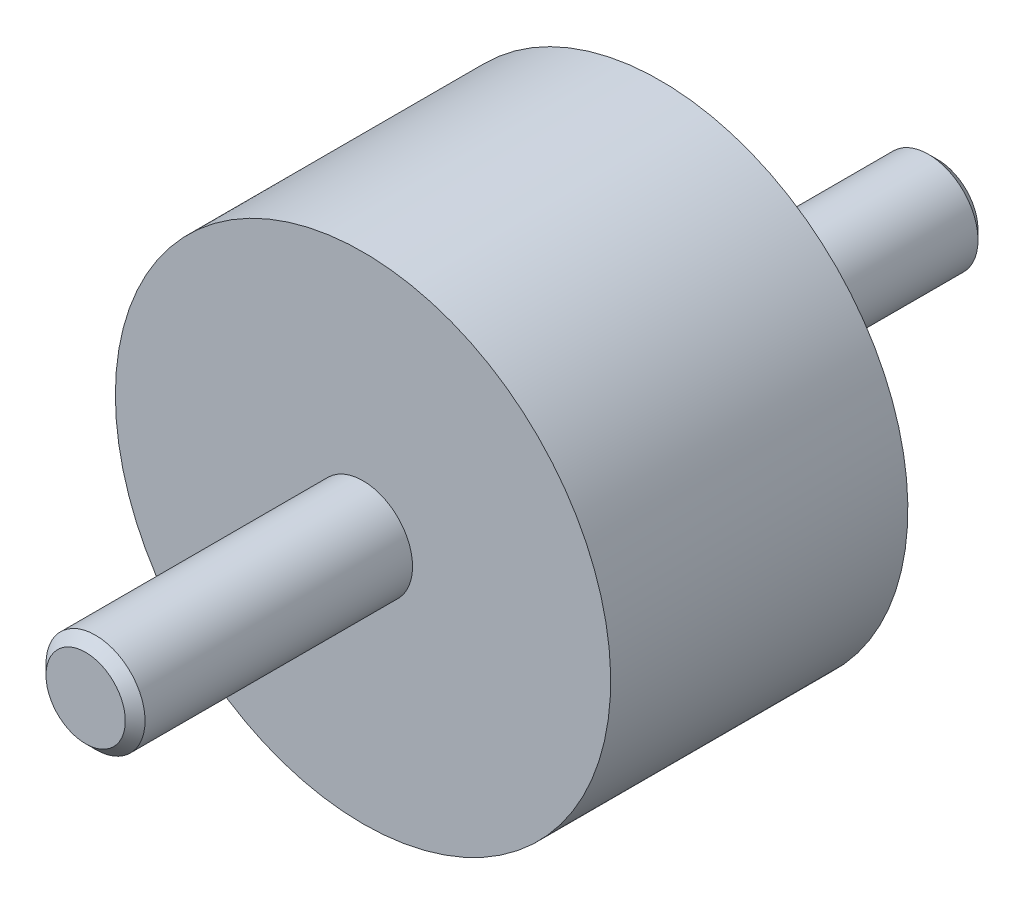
ISO-10303-21;
HEADER;
FILE_DESCRIPTION(('STEP AP214'),'2;1');
FILE_NAME('part.step','',(''),(''),'','','');
FILE_SCHEMA(('AUTOMOTIVE_DESIGN { 1 0 10303 214 1 1 1 1 }'));
ENDSEC;
DATA;
#1=APPLICATION_CONTEXT('core data for automotive mechanical design processes');
#2=APPLICATION_PROTOCOL_DEFINITION('international standard','automotive_design',2000,#1);
#3=PRODUCT_CONTEXT('',#1,'mechanical');
#4=PRODUCT('Part','Part','',(#3));
#5=PRODUCT_RELATED_PRODUCT_CATEGORY('part','',(#4));
#6=PRODUCT_DEFINITION_FORMATION('','',#4);
#7=PRODUCT_DEFINITION_CONTEXT('part definition',#1,'design');
#8=PRODUCT_DEFINITION('design','',#6,#7);
#9=PRODUCT_DEFINITION_SHAPE('','',#8);
#10=(LENGTH_UNIT() NAMED_UNIT(*) SI_UNIT(.MILLI.,.METRE.));
#11=(NAMED_UNIT(*) PLANE_ANGLE_UNIT() SI_UNIT($,.RADIAN.));
#12=(NAMED_UNIT(*) SI_UNIT($,.STERADIAN.) SOLID_ANGLE_UNIT());
#13=UNCERTAINTY_MEASURE_WITH_UNIT(LENGTH_MEASURE(1.E-05),#10,'distance_accuracy_value','');
#14=(GEOMETRIC_REPRESENTATION_CONTEXT(3) GLOBAL_UNCERTAINTY_ASSIGNED_CONTEXT((#13)) GLOBAL_UNIT_ASSIGNED_CONTEXT((#10,
#11,#12)) REPRESENTATION_CONTEXT('',''));
#15=CARTESIAN_POINT('',(0.,0.,0.));
#16=DIRECTION('',(0.,0.,1.));
#17=DIRECTION('',(1.,0.,0.));
#18=AXIS2_PLACEMENT_3D('',#15,#16,#17);
#19=CARTESIAN_POINT('',(0.,0.,0.66666666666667));
#20=DIRECTION('',(0.,0.,1.));
#21=DIRECTION('',(0.,-1.,0.));
#22=AXIS2_PLACEMENT_3D('',#19,#20,#21);
#23=CYLINDRICAL_SURFACE('',#22,25.);
#24=CARTESIAN_POINT('',(0.,0.,0.));
#25=DIRECTION('',(0.,0.,1.));
#26=DIRECTION('',(0.,-1.,0.));
#27=AXIS2_PLACEMENT_3D('',#24,#25,#26);
#28=CIRCLE('',#27,25.);
#29=CARTESIAN_POINT('',(0.,-25.,0.));
#30=VERTEX_POINT('',#29);
#31=EDGE_CURVE('E22',#30,#30,#28,.T.);
#32=ORIENTED_EDGE('',*,*,#31,.T.);
#33=EDGE_LOOP('',(#32));
#34=FACE_BOUND('',#33,.T.);
#35=CARTESIAN_POINT('',(0.,0.,30.));
#36=DIRECTION('',(0.,0.,-1.));
#37=DIRECTION('',(-1.,0.,0.));
#38=AXIS2_PLACEMENT_3D('',#35,#36,#37);
#39=CIRCLE('',#38,25.);
#40=CARTESIAN_POINT('',(-25.,0.,30.));
#41=VERTEX_POINT('',#40);
#42=EDGE_CURVE('E34',#41,#41,#39,.T.);
#43=ORIENTED_EDGE('',*,*,#42,.T.);
#44=EDGE_LOOP('',(#43));
#45=FACE_BOUND('',#44,.T.);
#46=ADVANCED_FACE('F12',(#34,#45),#23,.T.);
#47=CARTESIAN_POINT('',(25.,0.,0.));
#48=DIRECTION('',(0.,0.,-1.));
#49=DIRECTION('',(0.,1.,0.));
#50=AXIS2_PLACEMENT_3D('',#47,#48,#49);
#51=PLANE('',#50);
#52=CARTESIAN_POINT('',(0.,0.,0.));
#53=DIRECTION('',(0.,0.,-1.));
#54=DIRECTION('',(0.,1.,0.));
#55=AXIS2_PLACEMENT_3D('',#52,#53,#54);
#56=CIRCLE('',#55,5.);
#57=CARTESIAN_POINT('',(0.,5.,0.));
#58=VERTEX_POINT('',#57);
#59=EDGE_CURVE('E18',#58,#58,#56,.T.);
#60=ORIENTED_EDGE('',*,*,#59,.F.);
#61=EDGE_LOOP('',(#60));
#62=FACE_BOUND('',#61,.T.);
#63=ORIENTED_EDGE('',*,*,#31,.F.);
#64=EDGE_LOOP('',(#63));
#65=FACE_BOUND('',#64,.T.);
#66=ADVANCED_FACE('F57',(#62,#65),#51,.T.);
#67=CARTESIAN_POINT('',(0.,0.,-28.));
#68=DIRECTION('',(0.,0.,1.));
#69=DIRECTION('',(0.,-1.,0.));
#70=AXIS2_PLACEMENT_3D('',#67,#68,#69);
#71=CYLINDRICAL_SURFACE('',#70,5.);
#72=CARTESIAN_POINT('',(0.,0.,-27.08));
#73=DIRECTION('',(0.,0.,1.));
#74=DIRECTION('',(0.,-1.,0.));
#75=AXIS2_PLACEMENT_3D('',#72,#73,#74);
#76=CIRCLE('',#75,5.);
#77=CARTESIAN_POINT('',(0.,-5.,-27.08));
#78=VERTEX_POINT('',#77);
#79=EDGE_CURVE('E26',#78,#78,#76,.T.);
#80=ORIENTED_EDGE('',*,*,#79,.T.);
#81=EDGE_LOOP('',(#80));
#82=FACE_BOUND('',#81,.T.);
#83=ORIENTED_EDGE('',*,*,#59,.T.);
#84=EDGE_LOOP('',(#83));
#85=FACE_BOUND('',#84,.T.);
#86=ADVANCED_FACE('F62',(#82,#85),#71,.T.);
#87=CARTESIAN_POINT('',(0.,0.,-27.08));
#88=DIRECTION('',(0.,0.,1.));
#89=DIRECTION('',(0.,-1.,0.));
#90=AXIS2_PLACEMENT_3D('',#87,#88,#89);
#91=CONICAL_SURFACE('',#90,5.,0.785398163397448);
#92=CARTESIAN_POINT('',(0.,0.,-28.));
#93=DIRECTION('',(0.,0.,1.));
#94=DIRECTION('',(0.,-1.,0.));
#95=AXIS2_PLACEMENT_3D('',#92,#93,#94);
#96=CIRCLE('',#95,4.08);
#97=CARTESIAN_POINT('',(0.,-4.08,-28.));
#98=VERTEX_POINT('',#97);
#99=EDGE_CURVE('E31',#98,#98,#96,.T.);
#100=ORIENTED_EDGE('',*,*,#99,.T.);
#101=EDGE_LOOP('',(#100));
#102=FACE_BOUND('',#101,.T.);
#103=ORIENTED_EDGE('',*,*,#79,.F.);
#104=EDGE_LOOP('',(#103));
#105=FACE_BOUND('',#104,.T.);
#106=ADVANCED_FACE('F78',(#102,#105),#91,.T.);
#107=CARTESIAN_POINT('',(4.08,0.,-28.));
#108=DIRECTION('',(0.,0.,-1.));
#109=DIRECTION('',(0.,1.,0.));
#110=AXIS2_PLACEMENT_3D('',#107,#108,#109);
#111=PLANE('',#110);
#112=ORIENTED_EDGE('',*,*,#99,.F.);
#113=EDGE_LOOP('',(#112));
#114=FACE_BOUND('',#113,.T.);
#115=ADVANCED_FACE('F70',(#114),#111,.T.);
#116=CARTESIAN_POINT('',(0.,25.,30.));
#117=DIRECTION('',(0.,0.,1.));
#118=DIRECTION('',(1.,0.,0.));
#119=AXIS2_PLACEMENT_3D('',#116,#117,#118);
#120=PLANE('',#119);
#121=CARTESIAN_POINT('',(0.,0.,30.));
#122=DIRECTION('',(0.,0.,1.));
#123=DIRECTION('',(1.,0.,0.));
#124=AXIS2_PLACEMENT_3D('',#121,#122,#123);
#125=CIRCLE('',#124,5.);
#126=CARTESIAN_POINT('',(5.,0.,30.));
#127=VERTEX_POINT('',#126);
#128=EDGE_CURVE('E8',#127,#127,#125,.F.);
#129=ORIENTED_EDGE('',*,*,#128,.T.);
#130=EDGE_LOOP('',(#129));
#131=FACE_BOUND('',#130,.T.);
#132=ORIENTED_EDGE('',*,*,#42,.F.);
#133=EDGE_LOOP('',(#132));
#134=FACE_BOUND('',#133,.T.);
#135=ADVANCED_FACE('F68',(#131,#134),#120,.T.);
#136=CARTESIAN_POINT('',(0.,0.,20.));
#137=DIRECTION('',(0.,0.,1.));
#138=DIRECTION('',(0.,-1.,0.));
#139=AXIS2_PLACEMENT_3D('',#136,#137,#138);
#140=CYLINDRICAL_SURFACE('',#139,5.);
#141=ORIENTED_EDGE('',*,*,#128,.F.);
#142=EDGE_LOOP('',(#141));
#143=FACE_BOUND('',#142,.T.);
#144=CARTESIAN_POINT('',(0.,0.,57.0023270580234));
#145=DIRECTION('',(0.,0.,-1.));
#146=DIRECTION('',(-1.,0.,0.));
#147=AXIS2_PLACEMENT_3D('',#144,#145,#146);
#148=CIRCLE('',#147,5.);
#149=CARTESIAN_POINT('',(-5.,0.,57.0023270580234));
#150=VERTEX_POINT('',#149);
#151=EDGE_CURVE('E37',#150,#150,#148,.T.);
#152=ORIENTED_EDGE('',*,*,#151,.T.);
#153=EDGE_LOOP('',(#152));
#154=FACE_BOUND('',#153,.T.);
#155=ADVANCED_FACE('F54',(#143,#154),#140,.T.);
#156=CARTESIAN_POINT('',(0.,0.,57.0023270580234));
#157=DIRECTION('',(0.,0.,-1.));
#158=DIRECTION('',(-1.,0.,0.));
#159=AXIS2_PLACEMENT_3D('',#156,#157,#158);
#160=CONICAL_SURFACE('',#159,5.,0.785398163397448);
#161=CARTESIAN_POINT('',(0.,0.,58.));
#162=DIRECTION('',(0.,0.,-1.));
#163=DIRECTION('',(-1.,0.,0.));
#164=AXIS2_PLACEMENT_3D('',#161,#162,#163);
#165=CIRCLE('',#164,4.00232705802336);
#166=CARTESIAN_POINT('',(-4.00232705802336,0.,58.));
#167=VERTEX_POINT('',#166);
#168=EDGE_CURVE('E40',#167,#167,#165,.T.);
#169=ORIENTED_EDGE('',*,*,#168,.T.);
#170=EDGE_LOOP('',(#169));
#171=FACE_BOUND('',#170,.T.);
#172=ORIENTED_EDGE('',*,*,#151,.F.);
#173=EDGE_LOOP('',(#172));
#174=FACE_BOUND('',#173,.T.);
#175=ADVANCED_FACE('F44',(#171,#174),#160,.T.);
#176=CARTESIAN_POINT('',(0.,4.00232705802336,58.));
#177=DIRECTION('',(0.,0.,1.));
#178=DIRECTION('',(1.,0.,0.));
#179=AXIS2_PLACEMENT_3D('',#176,#177,#178);
#180=PLANE('',#179);
#181=ORIENTED_EDGE('',*,*,#168,.F.);
#182=EDGE_LOOP('',(#181));
#183=FACE_BOUND('',#182,.T.);
#184=ADVANCED_FACE('F47',(#183),#180,.T.);
#185=CLOSED_SHELL('',(#46,#66,#86,#106,#115,#135,#155,#175,#184));
#186=MANIFOLD_SOLID_BREP('B1',#185);
#187=ADVANCED_BREP_SHAPE_REPRESENTATION('',(#18,#186),#14);
#188=SHAPE_DEFINITION_REPRESENTATION(#9,#187);
ENDSEC;
END-ISO-10303-21;
